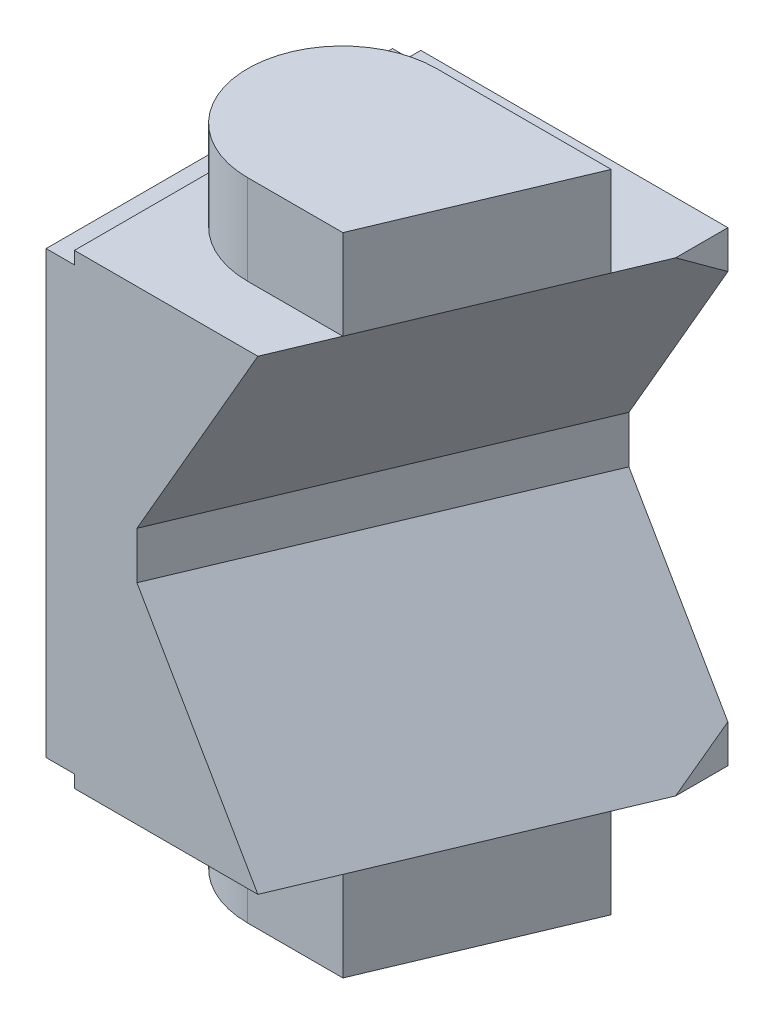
ISO-10303-21;
HEADER;
FILE_DESCRIPTION(('STEP AP214'),'2;1');
FILE_NAME('part.step','',(''),(''),'','','');
FILE_SCHEMA(('AUTOMOTIVE_DESIGN { 1 0 10303 214 1 1 1 1 }'));
ENDSEC;
DATA;
#1=APPLICATION_CONTEXT('core data for automotive mechanical design processes');
#2=APPLICATION_PROTOCOL_DEFINITION('international standard','automotive_design',2000,#1);
#3=PRODUCT_CONTEXT('',#1,'mechanical');
#4=PRODUCT('Part','Part','',(#3));
#5=PRODUCT_RELATED_PRODUCT_CATEGORY('part','',(#4));
#6=PRODUCT_DEFINITION_FORMATION('','',#4);
#7=PRODUCT_DEFINITION_CONTEXT('part definition',#1,'design');
#8=PRODUCT_DEFINITION('design','',#6,#7);
#9=PRODUCT_DEFINITION_SHAPE('','',#8);
#10=(LENGTH_UNIT() NAMED_UNIT(*) SI_UNIT(.MILLI.,.METRE.));
#11=(NAMED_UNIT(*) PLANE_ANGLE_UNIT() SI_UNIT($,.RADIAN.));
#12=(NAMED_UNIT(*) SI_UNIT($,.STERADIAN.) SOLID_ANGLE_UNIT());
#13=UNCERTAINTY_MEASURE_WITH_UNIT(LENGTH_MEASURE(1.E-05),#10,'distance_accuracy_value','');
#14=(GEOMETRIC_REPRESENTATION_CONTEXT(3) GLOBAL_UNCERTAINTY_ASSIGNED_CONTEXT((#13)) GLOBAL_UNIT_ASSIGNED_CONTEXT((#10,
#11,#12)) REPRESENTATION_CONTEXT('',''));
#15=CARTESIAN_POINT('',(0.,0.,0.));
#16=DIRECTION('',(0.,0.,1.));
#17=DIRECTION('',(1.,0.,0.));
#18=AXIS2_PLACEMENT_3D('',#15,#16,#17);
#19=CARTESIAN_POINT('',(21.3,0.,10.9));
#20=DIRECTION('',(1.,0.,0.));
#21=DIRECTION('',(0.,-1.,0.));
#22=AXIS2_PLACEMENT_3D('',#19,#20,#21);
#23=PLANE('',#22);
#24=DIRECTION('',(0.,0.,-1.));
#25=VECTOR('',#24,1.);
#26=CARTESIAN_POINT('',(21.3,14.8,22.));
#27=LINE('',#26,#25);
#28=CARTESIAN_POINT('',(21.3,14.8,3.318536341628));
#29=VERTEX_POINT('',#28);
#30=CARTESIAN_POINT('',(21.3,14.8,0.));
#31=VERTEX_POINT('',#30);
#32=EDGE_CURVE('E292',#29,#31,#27,.T.);
#33=ORIENTED_EDGE('',*,*,#32,.F.);
#34=DIRECTION('',(0.,0.588524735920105,0.808479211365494));
#35=VECTOR('',#34,1.);
#36=CARTESIAN_POINT('',(21.3,12.3843031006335,0.));
#37=LINE('',#36,#35);
#38=CARTESIAN_POINT('',(21.3,12.3843031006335,0.));
#39=VERTEX_POINT('',#38);
#40=EDGE_CURVE('E302',#39,#29,#37,.T.);
#41=ORIENTED_EDGE('',*,*,#40,.F.);
#42=DIRECTION('',(0.,-1.,0.));
#43=VECTOR('',#42,1.);
#44=CARTESIAN_POINT('',(21.3,0.,0.));
#45=LINE('',#44,#43);
#46=EDGE_CURVE('E282',#31,#39,#45,.T.);
#47=ORIENTED_EDGE('',*,*,#46,.F.);
#48=EDGE_LOOP('',(#33,#41,#47));
#49=FACE_BOUND('',#48,.T.);
#50=ADVANCED_FACE('F14',(#49),#23,.T.);
#51=CARTESIAN_POINT('',(21.3,0.,10.9));
#52=DIRECTION('',(1.,0.,0.));
#53=DIRECTION('',(0.,-1.,0.));
#54=AXIS2_PLACEMENT_3D('',#51,#52,#53);
#55=PLANE('',#54);
#56=DIRECTION('',(0.,0.588524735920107,-0.808479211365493));
#57=VECTOR('',#56,1.);
#58=CARTESIAN_POINT('',(21.3,-14.8,3.31853634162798));
#59=LINE('',#58,#57);
#60=CARTESIAN_POINT('',(21.3,-14.8,3.318536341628));
#61=VERTEX_POINT('',#60);
#62=CARTESIAN_POINT('',(21.3,-12.3843031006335,0.));
#63=VERTEX_POINT('',#62);
#64=EDGE_CURVE('E307',#61,#63,#59,.T.);
#65=ORIENTED_EDGE('',*,*,#64,.F.);
#66=DIRECTION('',(0.,0.,-1.));
#67=VECTOR('',#66,1.);
#68=CARTESIAN_POINT('',(21.3,-14.8,-0.200000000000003));
#69=LINE('',#68,#67);
#70=CARTESIAN_POINT('',(21.3,-14.8,0.));
#71=VERTEX_POINT('',#70);
#72=EDGE_CURVE('E312',#71,#61,#69,.F.);
#73=ORIENTED_EDGE('',*,*,#72,.F.);
#74=DIRECTION('',(0.,-1.,0.));
#75=VECTOR('',#74,1.);
#76=CARTESIAN_POINT('',(21.3,0.,0.));
#77=LINE('',#76,#75);
#78=EDGE_CURVE('E271',#63,#71,#77,.T.);
#79=ORIENTED_EDGE('',*,*,#78,.F.);
#80=EDGE_LOOP('',(#65,#73,#79));
#81=FACE_BOUND('',#80,.T.);
#82=ADVANCED_FACE('F373',(#81),#55,.T.);
#83=CARTESIAN_POINT('',(1.8,14.4,11.));
#84=DIRECTION('',(1.,0.,0.));
#85=DIRECTION('',(0.,0.,1.));
#86=AXIS2_PLACEMENT_3D('',#83,#84,#85);
#87=PLANE('',#86);
#88=DIRECTION('',(0.,0.,-1.));
#89=VECTOR('',#88,1.);
#90=CARTESIAN_POINT('',(1.8,14.,0.));
#91=LINE('',#90,#89);
#92=CARTESIAN_POINT('',(1.8,14.,0.));
#93=VERTEX_POINT('',#92);
#94=CARTESIAN_POINT('',(1.8,14.,22.));
#95=VERTEX_POINT('',#94);
#96=EDGE_CURVE('E262',#93,#95,#91,.F.);
#97=ORIENTED_EDGE('',*,*,#96,.T.);
#98=DIRECTION('',(0.,-1.,0.));
#99=VECTOR('',#98,1.);
#100=CARTESIAN_POINT('',(1.8,14.4,22.));
#101=LINE('',#100,#99);
#102=CARTESIAN_POINT('',(1.8,14.8,22.));
#103=VERTEX_POINT('',#102);
#104=EDGE_CURVE('E18',#103,#95,#101,.T.);
#105=ORIENTED_EDGE('',*,*,#104,.F.);
#106=DIRECTION('',(0.,0.,-1.));
#107=VECTOR('',#106,1.);
#108=CARTESIAN_POINT('',(1.8,14.8,22.));
#109=LINE('',#108,#107);
#110=CARTESIAN_POINT('',(1.8,14.8,0.));
#111=VERTEX_POINT('',#110);
#112=EDGE_CURVE('E297',#111,#103,#109,.F.);
#113=ORIENTED_EDGE('',*,*,#112,.F.);
#114=DIRECTION('',(0.,-1.,0.));
#115=VECTOR('',#114,1.);
#116=CARTESIAN_POINT('',(1.8,0.,0.));
#117=LINE('',#116,#115);
#118=EDGE_CURVE('E287',#93,#111,#117,.F.);
#119=ORIENTED_EDGE('',*,*,#118,.F.);
#120=EDGE_LOOP('',(#97,#105,#113,#119));
#121=FACE_BOUND('',#120,.T.);
#122=ADVANCED_FACE('F328',(#121),#87,.F.);
#123=CARTESIAN_POINT('',(2.,-14.8,-0.200000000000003));
#124=DIRECTION('',(0.,-1.,0.));
#125=DIRECTION('',(-1.,0.,0.));
#126=AXIS2_PLACEMENT_3D('',#123,#124,#125);
#127=PLANE('',#126);
#128=DIRECTION('',(1.,0.,0.));
#129=VECTOR('',#128,1.);
#130=CARTESIAN_POINT('',(9.,-14.8,18.2));
#131=LINE('',#130,#129);
#132=CARTESIAN_POINT('',(9.,-14.8,18.2));
#133=VERTEX_POINT('',#132);
#134=CARTESIAN_POINT('',(15.0456686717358,-14.8,18.2));
#135=VERTEX_POINT('',#134);
#136=EDGE_CURVE('E190',#133,#135,#131,.T.);
#137=ORIENTED_EDGE('',*,*,#136,.T.);
#138=DIRECTION('',(0.387449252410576,0.,-0.921891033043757));
#139=VECTOR('',#138,1.);
#140=CARTESIAN_POINT('',(13.4486174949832,-14.8,22.));
#141=LINE('',#140,#139);
#142=CARTESIAN_POINT('',(13.4486174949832,-14.8,22.));
#143=VERTEX_POINT('',#142);
#144=EDGE_CURVE('E309',#143,#135,#141,.T.);
#145=ORIENTED_EDGE('',*,*,#144,.F.);
#146=DIRECTION('',(-1.,0.,0.));
#147=VECTOR('',#146,1.);
#148=CARTESIAN_POINT('',(2.,-14.8,22.));
#149=LINE('',#148,#147);
#150=CARTESIAN_POINT('',(1.8,-14.8,22.));
#151=VERTEX_POINT('',#150);
#152=EDGE_CURVE('E257',#151,#143,#149,.F.);
#153=ORIENTED_EDGE('',*,*,#152,.F.);
#154=DIRECTION('',(0.,0.,-1.));
#155=VECTOR('',#154,1.);
#156=CARTESIAN_POINT('',(1.8,-14.8,11.));
#157=LINE('',#156,#155);
#158=CARTESIAN_POINT('',(1.8,-14.8,0.));
#159=VERTEX_POINT('',#158);
#160=EDGE_CURVE('E289',#151,#159,#157,.T.);
#161=ORIENTED_EDGE('',*,*,#160,.T.);
#162=DIRECTION('',(1.,0.,0.));
#163=VECTOR('',#162,1.);
#164=CARTESIAN_POINT('',(11.0228679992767,-14.8,0.));
#165=LINE('',#164,#163);
#166=EDGE_CURVE('E269',#71,#159,#165,.F.);
#167=ORIENTED_EDGE('',*,*,#166,.F.);
#168=ORIENTED_EDGE('',*,*,#72,.T.);
#169=CARTESIAN_POINT('',(20.0889881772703,-14.8,6.2));
#170=VERTEX_POINT('',#169);
#171=EDGE_CURVE('E311',#170,#61,#141,.T.);
#172=ORIENTED_EDGE('',*,*,#171,.F.);
#173=DIRECTION('',(-1.,0.,0.));
#174=VECTOR('',#173,1.);
#175=CARTESIAN_POINT('',(9.,-14.8,6.2));
#176=LINE('',#175,#174);
#177=CARTESIAN_POINT('',(9.,-14.8,6.2));
#178=VERTEX_POINT('',#177);
#179=EDGE_CURVE('E197',#170,#178,#176,.T.);
#180=ORIENTED_EDGE('',*,*,#179,.T.);
#181=CARTESIAN_POINT('',(9.,-14.8,12.2));
#182=DIRECTION('',(0.,-1.,0.));
#183=DIRECTION('',(-1.,0.,0.));
#184=AXIS2_PLACEMENT_3D('',#181,#182,#183);
#185=CIRCLE('',#184,6.);
#186=EDGE_CURVE('E194',#178,#133,#185,.F.);
#187=ORIENTED_EDGE('',*,*,#186,.T.);
#188=EDGE_LOOP('',(#137,#145,#153,#161,#167,#168,#172,#180,#187));
#189=FACE_BOUND('',#188,.T.);
#190=ADVANCED_FACE('F346',(#189),#127,.T.);
#191=CARTESIAN_POINT('',(15.9432315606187,-11.0406591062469,10.9));
#192=DIRECTION('',(0.813797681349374,0.469846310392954,0.342020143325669));
#193=DIRECTION('',(0.5,-0.866025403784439,0.));
#194=AXIS2_PLACEMENT_3D('',#191,#192,#193);
#195=PLANE('',#194);
#196=ORIENTED_EDGE('',*,*,#144,.T.);
#197=DIRECTION('',(0.387449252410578,0.,-0.921891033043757));
#198=VECTOR('',#197,1.);
#199=CARTESIAN_POINT('',(15.0456686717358,-14.8,18.2));
#200=LINE('',#199,#198);
#201=EDGE_CURVE('E187',#135,#170,#200,.T.);
#202=ORIENTED_EDGE('',*,*,#201,.T.);
#203=ORIENTED_EDGE('',*,*,#171,.T.);
#204=ORIENTED_EDGE('',*,*,#64,.T.);
#205=DIRECTION('',(0.5,-0.866025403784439,0.));
#206=VECTOR('',#205,1.);
#207=CARTESIAN_POINT('',(15.0159277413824,-1.4999706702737,0.));
#208=LINE('',#207,#206);
#209=CARTESIAN_POINT('',(15.0159277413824,-1.4999706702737,0.));
#210=VERTEX_POINT('',#209);
#211=EDGE_CURVE('E273',#210,#63,#208,.T.);
#212=ORIENTED_EDGE('',*,*,#211,.F.);
#213=DIRECTION('',(0.387515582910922,-0.000135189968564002,-0.921863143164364));
#214=VECTOR('',#213,1.);
#215=CARTESIAN_POINT('',(5.76797929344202,-1.49674440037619,22.));
#216=LINE('',#215,#214);
#217=CARTESIAN_POINT('',(5.76797929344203,-1.49674440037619,22.));
#218=VERTEX_POINT('',#217);
#219=EDGE_CURVE('E305',#218,#210,#216,.T.);
#220=ORIENTED_EDGE('',*,*,#219,.F.);
#221=DIRECTION('',(-0.5,0.866025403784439,0.));
#222=VECTOR('',#221,1.);
#223=CARTESIAN_POINT('',(13.4486174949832,-14.8,22.));
#224=LINE('',#223,#222);
#225=EDGE_CURVE('E255',#143,#218,#224,.T.);
#226=ORIENTED_EDGE('',*,*,#225,.F.);
#227=EDGE_LOOP('',(#196,#202,#203,#204,#212,#220,#226));
#228=FACE_BOUND('',#227,.T.);
#229=ADVANCED_FACE('F350',(#228),#195,.T.);
#230=CARTESIAN_POINT('',(10.433989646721,-8.15,10.9));
#231=DIRECTION('',(0.921863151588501,0.,0.387515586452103));
#232=DIRECTION('',(-0.387515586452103,0.,0.921863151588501));
#233=AXIS2_PLACEMENT_3D('',#230,#231,#232);
#234=PLANE('',#233);
#235=DIRECTION('',(0.,-1.,0.));
#236=VECTOR('',#235,1.);
#237=CARTESIAN_POINT('',(5.76797929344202,-14.8,22.));
#238=LINE('',#237,#236);
#239=CARTESIAN_POINT('',(5.76797929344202,1.49674440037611,22.));
#240=VERTEX_POINT('',#239);
#241=EDGE_CURVE('E253',#218,#240,#238,.F.);
#242=ORIENTED_EDGE('',*,*,#241,.F.);
#243=ORIENTED_EDGE('',*,*,#219,.T.);
#244=DIRECTION('',(0.,-1.,0.));
#245=VECTOR('',#244,1.);
#246=CARTESIAN_POINT('',(15.0159277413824,0.,0.));
#247=LINE('',#246,#245);
#248=CARTESIAN_POINT('',(15.0159277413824,1.49997067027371,0.));
#249=VERTEX_POINT('',#248);
#250=EDGE_CURVE('E276',#249,#210,#247,.T.);
#251=ORIENTED_EDGE('',*,*,#250,.F.);
#252=DIRECTION('',(0.387515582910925,0.000135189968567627,-0.921863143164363));
#253=VECTOR('',#252,1.);
#254=CARTESIAN_POINT('',(5.767979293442,1.49674440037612,22.));
#255=LINE('',#254,#253);
#256=EDGE_CURVE('E300',#240,#249,#255,.T.);
#257=ORIENTED_EDGE('',*,*,#256,.F.);
#258=EDGE_LOOP('',(#242,#243,#251,#257));
#259=FACE_BOUND('',#258,.T.);
#260=ADVANCED_FACE('F358',(#259),#234,.T.);
#261=CARTESIAN_POINT('',(6.43464357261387,-5.4286983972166,10.9));
#262=DIRECTION('',(0.813797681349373,-0.469846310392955,0.342020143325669));
#263=DIRECTION('',(-0.5,-0.866025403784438,0.));
#264=AXIS2_PLACEMENT_3D('',#261,#262,#263);
#265=PLANE('',#264);
#266=DIRECTION('',(0.5,0.866025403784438,0.));
#267=VECTOR('',#266,1.);
#268=CARTESIAN_POINT('',(5.76797929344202,1.4967444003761,22.));
#269=LINE('',#268,#267);
#270=CARTESIAN_POINT('',(13.4486174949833,14.8,22.));
#271=VERTEX_POINT('',#270);
#272=EDGE_CURVE('E251',#240,#271,#269,.T.);
#273=ORIENTED_EDGE('',*,*,#272,.F.);
#274=ORIENTED_EDGE('',*,*,#256,.T.);
#275=DIRECTION('',(-0.5,-0.866025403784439,0.));
#276=VECTOR('',#275,1.);
#277=CARTESIAN_POINT('',(21.3,12.3843031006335,0.));
#278=LINE('',#277,#276);
#279=EDGE_CURVE('E279',#39,#249,#278,.T.);
#280=ORIENTED_EDGE('',*,*,#279,.F.);
#281=ORIENTED_EDGE('',*,*,#40,.T.);
#282=DIRECTION('',(0.387449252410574,0.,-0.921891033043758));
#283=VECTOR('',#282,1.);
#284=CARTESIAN_POINT('',(13.4486174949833,14.8,22.));
#285=LINE('',#284,#283);
#286=CARTESIAN_POINT('',(20.0889881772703,14.8,6.2));
#287=VERTEX_POINT('',#286);
#288=EDGE_CURVE('E296',#287,#29,#285,.T.);
#289=ORIENTED_EDGE('',*,*,#288,.F.);
#290=DIRECTION('',(-0.387449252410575,0.,0.921891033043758));
#291=VECTOR('',#290,1.);
#292=CARTESIAN_POINT('',(15.0456686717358,14.8,18.2));
#293=LINE('',#292,#291);
#294=CARTESIAN_POINT('',(15.0456686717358,14.8,18.2));
#295=VERTEX_POINT('',#294);
#296=EDGE_CURVE('E181',#287,#295,#293,.T.);
#297=ORIENTED_EDGE('',*,*,#296,.T.);
#298=EDGE_CURVE('E294',#271,#295,#285,.T.);
#299=ORIENTED_EDGE('',*,*,#298,.F.);
#300=EDGE_LOOP('',(#273,#274,#280,#281,#289,#297,#299));
#301=FACE_BOUND('',#300,.T.);
#302=ADVANCED_FACE('F361',(#301),#265,.T.);
#303=CARTESIAN_POINT('',(2.,14.8,22.));
#304=DIRECTION('',(0.,1.,0.));
#305=DIRECTION('',(1.,0.,0.));
#306=AXIS2_PLACEMENT_3D('',#303,#304,#305);
#307=PLANE('',#306);
#308=DIRECTION('',(1.,0.,0.));
#309=VECTOR('',#308,1.);
#310=CARTESIAN_POINT('',(9.,14.8,6.2));
#311=LINE('',#310,#309);
#312=CARTESIAN_POINT('',(9.,14.8,6.2));
#313=VERTEX_POINT('',#312);
#314=EDGE_CURVE('E660',#313,#287,#311,.T.);
#315=ORIENTED_EDGE('',*,*,#314,.T.);
#316=ORIENTED_EDGE('',*,*,#288,.T.);
#317=ORIENTED_EDGE('',*,*,#32,.T.);
#318=DIRECTION('',(1.,0.,0.));
#319=VECTOR('',#318,1.);
#320=CARTESIAN_POINT('',(11.0228679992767,14.8,0.));
#321=LINE('',#320,#319);
#322=EDGE_CURVE('E284',#111,#31,#321,.T.);
#323=ORIENTED_EDGE('',*,*,#322,.F.);
#324=ORIENTED_EDGE('',*,*,#112,.T.);
#325=DIRECTION('',(-1.,0.,0.));
#326=VECTOR('',#325,1.);
#327=CARTESIAN_POINT('',(2.,14.8,22.));
#328=LINE('',#327,#326);
#329=EDGE_CURVE('E248',#271,#103,#328,.T.);
#330=ORIENTED_EDGE('',*,*,#329,.F.);
#331=ORIENTED_EDGE('',*,*,#298,.T.);
#332=DIRECTION('',(-1.,0.,0.));
#333=VECTOR('',#332,1.);
#334=CARTESIAN_POINT('',(9.,14.8,18.2));
#335=LINE('',#334,#333);
#336=CARTESIAN_POINT('',(9.,14.8,18.2));
#337=VERTEX_POINT('',#336);
#338=EDGE_CURVE('E36',#295,#337,#335,.T.);
#339=ORIENTED_EDGE('',*,*,#338,.T.);
#340=CARTESIAN_POINT('',(9.,14.8,12.2));
#341=DIRECTION('',(0.,1.,0.));
#342=DIRECTION('',(1.,0.,0.));
#343=AXIS2_PLACEMENT_3D('',#340,#341,#342);
#344=CIRCLE('',#343,6.);
#345=EDGE_CURVE('E31',#337,#313,#344,.F.);
#346=ORIENTED_EDGE('',*,*,#345,.T.);
#347=EDGE_LOOP('',(#315,#316,#317,#323,#324,#330,#331,#339,#346));
#348=FACE_BOUND('',#347,.T.);
#349=ADVANCED_FACE('F365',(#348),#307,.T.);
#350=CARTESIAN_POINT('',(1.8,-14.4,11.));
#351=DIRECTION('',(1.,0.,0.));
#352=DIRECTION('',(0.,-1.,0.));
#353=AXIS2_PLACEMENT_3D('',#350,#351,#352);
#354=PLANE('',#353);
#355=DIRECTION('',(0.,0.,-1.));
#356=VECTOR('',#355,1.);
#357=CARTESIAN_POINT('',(1.8,-14.,22.));
#358=LINE('',#357,#356);
#359=CARTESIAN_POINT('',(1.8,-14.,22.));
#360=VERTEX_POINT('',#359);
#361=CARTESIAN_POINT('',(1.8,-14.,0.));
#362=VERTEX_POINT('',#361);
#363=EDGE_CURVE('E239',#360,#362,#358,.T.);
#364=ORIENTED_EDGE('',*,*,#363,.T.);
#365=DIRECTION('',(0.,-1.,0.));
#366=VECTOR('',#365,1.);
#367=CARTESIAN_POINT('',(1.8,0.,0.));
#368=LINE('',#367,#366);
#369=EDGE_CURVE('E267',#159,#362,#368,.F.);
#370=ORIENTED_EDGE('',*,*,#369,.F.);
#371=ORIENTED_EDGE('',*,*,#160,.F.);
#372=DIRECTION('',(0.,-1.,0.));
#373=VECTOR('',#372,1.);
#374=CARTESIAN_POINT('',(1.8,-14.8,22.));
#375=LINE('',#374,#373);
#376=EDGE_CURVE('E259',#360,#151,#375,.T.);
#377=ORIENTED_EDGE('',*,*,#376,.F.);
#378=EDGE_LOOP('',(#364,#370,#371,#377));
#379=FACE_BOUND('',#378,.T.);
#380=ADVANCED_FACE('F408',(#379),#354,.F.);
#381=CARTESIAN_POINT('',(11.0228679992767,0.,0.));
#382=DIRECTION('',(0.,0.,-1.));
#383=DIRECTION('',(1.,0.,0.));
#384=AXIS2_PLACEMENT_3D('',#381,#382,#383);
#385=PLANE('',#384);
#386=DIRECTION('',(1.,0.,0.));
#387=VECTOR('',#386,1.);
#388=CARTESIAN_POINT('',(0.,-14.,0.));
#389=LINE('',#388,#387);
#390=CARTESIAN_POINT('',(0.,-14.,0.));
#391=VERTEX_POINT('',#390);
#392=EDGE_CURVE('E237',#362,#391,#389,.F.);
#393=ORIENTED_EDGE('',*,*,#392,.T.);
#394=DIRECTION('',(0.,1.,0.));
#395=VECTOR('',#394,1.);
#396=CARTESIAN_POINT('',(0.,-14.915922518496,0.));
#397=LINE('',#396,#395);
#398=CARTESIAN_POINT('',(0.,14.,0.));
#399=VERTEX_POINT('',#398);
#400=EDGE_CURVE('E228',#391,#399,#397,.T.);
#401=ORIENTED_EDGE('',*,*,#400,.T.);
#402=DIRECTION('',(-1.,0.,0.));
#403=VECTOR('',#402,1.);
#404=CARTESIAN_POINT('',(0.,14.,0.));
#405=LINE('',#404,#403);
#406=EDGE_CURVE('E265',#399,#93,#405,.F.);
#407=ORIENTED_EDGE('',*,*,#406,.T.);
#408=ORIENTED_EDGE('',*,*,#118,.T.);
#409=ORIENTED_EDGE('',*,*,#322,.T.);
#410=ORIENTED_EDGE('',*,*,#46,.T.);
#411=ORIENTED_EDGE('',*,*,#279,.T.);
#412=ORIENTED_EDGE('',*,*,#250,.T.);
#413=ORIENTED_EDGE('',*,*,#211,.T.);
#414=ORIENTED_EDGE('',*,*,#78,.T.);
#415=ORIENTED_EDGE('',*,*,#166,.T.);
#416=ORIENTED_EDGE('',*,*,#369,.T.);
#417=EDGE_LOOP('',(#393,#401,#407,#408,#409,#410,#411,#412,#413,#414,#415,#416));
#418=FACE_BOUND('',#417,.T.);
#419=ADVANCED_FACE('F337',(#418),#385,.T.);
#420=CARTESIAN_POINT('',(0.,14.,0.));
#421=DIRECTION('',(0.,-1.,0.));
#422=DIRECTION('',(-1.,0.,0.));
#423=AXIS2_PLACEMENT_3D('',#420,#421,#422);
#424=PLANE('',#423);
#425=ORIENTED_EDGE('',*,*,#96,.F.);
#426=ORIENTED_EDGE('',*,*,#406,.F.);
#427=DIRECTION('',(0.,0.,-1.));
#428=VECTOR('',#427,1.);
#429=CARTESIAN_POINT('',(0.,14.,11.));
#430=LINE('',#429,#428);
#431=CARTESIAN_POINT('',(0.,14.,22.));
#432=VERTEX_POINT('',#431);
#433=EDGE_CURVE('E235',#399,#432,#430,.F.);
#434=ORIENTED_EDGE('',*,*,#433,.T.);
#435=DIRECTION('',(-1.,0.,0.));
#436=VECTOR('',#435,1.);
#437=CARTESIAN_POINT('',(2.,14.,22.));
#438=LINE('',#437,#436);
#439=EDGE_CURVE('E245',#95,#432,#438,.T.);
#440=ORIENTED_EDGE('',*,*,#439,.F.);
#441=EDGE_LOOP('',(#425,#426,#434,#440));
#442=FACE_BOUND('',#441,.T.);
#443=ADVANCED_FACE('F330',(#442),#424,.F.);
#444=CARTESIAN_POINT('',(2.,-14.8,22.));
#445=DIRECTION('',(0.,0.,1.));
#446=DIRECTION('',(-1.,0.,0.));
#447=AXIS2_PLACEMENT_3D('',#444,#445,#446);
#448=PLANE('',#447);
#449=DIRECTION('',(0.,-1.,0.));
#450=VECTOR('',#449,1.);
#451=CARTESIAN_POINT('',(0.,0.,22.));
#452=LINE('',#451,#450);
#453=CARTESIAN_POINT('',(0.,-14.,22.));
#454=VERTEX_POINT('',#453);
#455=EDGE_CURVE('E23',#432,#454,#452,.T.);
#456=ORIENTED_EDGE('',*,*,#455,.T.);
#457=DIRECTION('',(1.,0.,0.));
#458=VECTOR('',#457,1.);
#459=CARTESIAN_POINT('',(0.,-14.,22.));
#460=LINE('',#459,#458);
#461=EDGE_CURVE('E242',#454,#360,#460,.T.);
#462=ORIENTED_EDGE('',*,*,#461,.T.);
#463=ORIENTED_EDGE('',*,*,#376,.T.);
#464=ORIENTED_EDGE('',*,*,#152,.T.);
#465=ORIENTED_EDGE('',*,*,#225,.T.);
#466=ORIENTED_EDGE('',*,*,#241,.T.);
#467=ORIENTED_EDGE('',*,*,#272,.T.);
#468=ORIENTED_EDGE('',*,*,#329,.T.);
#469=ORIENTED_EDGE('',*,*,#104,.T.);
#470=ORIENTED_EDGE('',*,*,#439,.T.);
#471=EDGE_LOOP('',(#456,#462,#463,#464,#465,#466,#467,#468,#469,#470));
#472=FACE_BOUND('',#471,.T.);
#473=ADVANCED_FACE('F320',(#472),#448,.T.);
#474=CARTESIAN_POINT('',(0.,-14.,22.));
#475=DIRECTION('',(0.,1.,0.));
#476=DIRECTION('',(1.,0.,0.));
#477=AXIS2_PLACEMENT_3D('',#474,#475,#476);
#478=PLANE('',#477);
#479=DIRECTION('',(0.,0.,-1.));
#480=VECTOR('',#479,1.);
#481=CARTESIAN_POINT('',(0.,-14.,11.));
#482=LINE('',#481,#480);
#483=EDGE_CURVE('E9',#454,#391,#482,.T.);
#484=ORIENTED_EDGE('',*,*,#483,.T.);
#485=ORIENTED_EDGE('',*,*,#392,.F.);
#486=ORIENTED_EDGE('',*,*,#363,.F.);
#487=ORIENTED_EDGE('',*,*,#461,.F.);
#488=EDGE_LOOP('',(#484,#485,#486,#487));
#489=FACE_BOUND('',#488,.T.);
#490=ADVANCED_FACE('F342',(#489),#478,.F.);
#491=CARTESIAN_POINT('',(0.,0.,11.));
#492=DIRECTION('',(1.,0.,0.));
#493=DIRECTION('',(0.,-1.,0.));
#494=AXIS2_PLACEMENT_3D('',#491,#492,#493);
#495=PLANE('',#494);
#496=CARTESIAN_POINT('',(0.,9.,11.));
#497=DIRECTION('',(-1.,0.,0.));
#498=DIRECTION('',(0.,1.,0.));
#499=AXIS2_PLACEMENT_3D('',#496,#497,#498);
#500=CIRCLE('',#499,2.5);
#501=CARTESIAN_POINT('',(0.,11.5,11.));
#502=VERTEX_POINT('',#501);
#503=EDGE_CURVE('E218',#502,#502,#500,.T.);
#504=ORIENTED_EDGE('',*,*,#503,.F.);
#505=EDGE_LOOP('',(#504));
#506=FACE_BOUND('',#505,.T.);
#507=CARTESIAN_POINT('',(0.,-9.,11.));
#508=DIRECTION('',(-1.,0.,0.));
#509=DIRECTION('',(0.,1.,0.));
#510=AXIS2_PLACEMENT_3D('',#507,#508,#509);
#511=CIRCLE('',#510,2.5);
#512=CARTESIAN_POINT('',(0.,-6.5,11.));
#513=VERTEX_POINT('',#512);
#514=EDGE_CURVE('E222',#513,#513,#511,.T.);
#515=ORIENTED_EDGE('',*,*,#514,.F.);
#516=EDGE_LOOP('',(#515));
#517=FACE_BOUND('',#516,.T.);
#518=ORIENTED_EDGE('',*,*,#455,.F.);
#519=ORIENTED_EDGE('',*,*,#433,.F.);
#520=ORIENTED_EDGE('',*,*,#400,.F.);
#521=ORIENTED_EDGE('',*,*,#483,.F.);
#522=EDGE_LOOP('',(#518,#519,#520,#521));
#523=FACE_BOUND('',#522,.T.);
#524=ADVANCED_FACE('F334',(#506,#517,#523),#495,.F.);
#525=CARTESIAN_POINT('',(7.,-9.,11.));
#526=DIRECTION('',(-1.,0.,0.));
#527=DIRECTION('',(0.,1.,0.));
#528=AXIS2_PLACEMENT_3D('',#525,#526,#527);
#529=PLANE('',#528);
#530=CARTESIAN_POINT('',(7.,-9.,11.));
#531=DIRECTION('',(-1.,0.,0.));
#532=DIRECTION('',(0.,1.,0.));
#533=AXIS2_PLACEMENT_3D('',#530,#531,#532);
#534=CIRCLE('',#533,2.5);
#535=CARTESIAN_POINT('',(7.,-6.5,11.));
#536=VERTEX_POINT('',#535);
#537=EDGE_CURVE('E225',#536,#536,#534,.T.);
#538=ORIENTED_EDGE('',*,*,#537,.T.);
#539=EDGE_LOOP('',(#538));
#540=FACE_BOUND('',#539,.T.);
#541=ADVANCED_FACE('F384',(#540),#529,.T.);
#542=CARTESIAN_POINT('',(7.,-9.,11.));
#543=DIRECTION('',(-1.,0.,0.));
#544=DIRECTION('',(0.,1.,0.));
#545=AXIS2_PLACEMENT_3D('',#542,#543,#544);
#546=CYLINDRICAL_SURFACE('',#545,2.5);
#547=ORIENTED_EDGE('',*,*,#537,.F.);
#548=EDGE_LOOP('',(#547));
#549=FACE_BOUND('',#548,.T.);
#550=ORIENTED_EDGE('',*,*,#514,.T.);
#551=EDGE_LOOP('',(#550));
#552=FACE_BOUND('',#551,.T.);
#553=ADVANCED_FACE('F394',(#549,#552),#546,.F.);
#554=CARTESIAN_POINT('',(7.,9.,11.));
#555=DIRECTION('',(-1.,0.,0.));
#556=DIRECTION('',(0.,1.,0.));
#557=AXIS2_PLACEMENT_3D('',#554,#555,#556);
#558=PLANE('',#557);
#559=CARTESIAN_POINT('',(7.,9.,11.));
#560=DIRECTION('',(-1.,0.,0.));
#561=DIRECTION('',(0.,1.,0.));
#562=AXIS2_PLACEMENT_3D('',#559,#560,#561);
#563=CIRCLE('',#562,2.5);
#564=CARTESIAN_POINT('',(7.,11.5,11.));
#565=VERTEX_POINT('',#564);
#566=EDGE_CURVE('E219',#565,#565,#563,.T.);
#567=ORIENTED_EDGE('',*,*,#566,.T.);
#568=EDGE_LOOP('',(#567));
#569=FACE_BOUND('',#568,.T.);
#570=ADVANCED_FACE('F521',(#569),#558,.T.);
#571=CARTESIAN_POINT('',(7.,9.,11.));
#572=DIRECTION('',(-1.,0.,0.));
#573=DIRECTION('',(0.,1.,0.));
#574=AXIS2_PLACEMENT_3D('',#571,#572,#573);
#575=CYLINDRICAL_SURFACE('',#574,2.5);
#576=ORIENTED_EDGE('',*,*,#566,.F.);
#577=EDGE_LOOP('',(#576));
#578=FACE_BOUND('',#577,.T.);
#579=ORIENTED_EDGE('',*,*,#503,.T.);
#580=EDGE_LOOP('',(#579));
#581=FACE_BOUND('',#580,.T.);
#582=ADVANCED_FACE('F530',(#578,#581),#575,.F.);
#583=CARTESIAN_POINT('',(9.,6.08141558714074,12.2));
#584=DIRECTION('',(0.,-1.,0.));
#585=DIRECTION('',(-1.,0.,0.));
#586=AXIS2_PLACEMENT_3D('',#583,#584,#585);
#587=CYLINDRICAL_SURFACE('',#586,6.);
#588=ORIENTED_EDGE('',*,*,#186,.F.);
#589=DIRECTION('',(0.,-1.,0.));
#590=VECTOR('',#589,1.);
#591=CARTESIAN_POINT('',(9.,6.08141558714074,6.2));
#592=LINE('',#591,#590);
#593=CARTESIAN_POINT('',(9.,-20.5,6.2));
#594=VERTEX_POINT('',#593);
#595=EDGE_CURVE('E209',#178,#594,#592,.T.);
#596=ORIENTED_EDGE('',*,*,#595,.T.);
#597=CARTESIAN_POINT('',(9.,-20.5,12.2));
#598=DIRECTION('',(0.,-1.,0.));
#599=DIRECTION('',(-1.,0.,0.));
#600=AXIS2_PLACEMENT_3D('',#597,#598,#599);
#601=CIRCLE('',#600,6.);
#602=CARTESIAN_POINT('',(9.,-20.5,18.2));
#603=VERTEX_POINT('',#602);
#604=EDGE_CURVE('E186',#603,#594,#601,.T.);
#605=ORIENTED_EDGE('',*,*,#604,.F.);
#606=DIRECTION('',(0.,-1.,0.));
#607=VECTOR('',#606,1.);
#608=CARTESIAN_POINT('',(9.,6.08141558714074,18.2));
#609=LINE('',#608,#607);
#610=EDGE_CURVE('E191',#133,#603,#609,.T.);
#611=ORIENTED_EDGE('',*,*,#610,.F.);
#612=EDGE_LOOP('',(#588,#596,#605,#611));
#613=FACE_BOUND('',#612,.T.);
#614=ADVANCED_FACE('F541',(#613),#587,.T.);
#615=CARTESIAN_POINT('',(9.,6.08141558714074,18.2));
#616=DIRECTION('',(0.,0.,1.));
#617=DIRECTION('',(-1.,0.,0.));
#618=AXIS2_PLACEMENT_3D('',#615,#616,#617);
#619=PLANE('',#618);
#620=ORIENTED_EDGE('',*,*,#136,.F.);
#621=ORIENTED_EDGE('',*,*,#610,.T.);
#622=DIRECTION('',(-1.,0.,0.));
#623=VECTOR('',#622,1.);
#624=CARTESIAN_POINT('',(9.,-20.5,18.2));
#625=LINE('',#624,#623);
#626=CARTESIAN_POINT('',(15.0456686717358,-20.5,18.2));
#627=VERTEX_POINT('',#626);
#628=EDGE_CURVE('E206',#627,#603,#625,.T.);
#629=ORIENTED_EDGE('',*,*,#628,.F.);
#630=DIRECTION('',(0.,-1.,0.));
#631=VECTOR('',#630,1.);
#632=CARTESIAN_POINT('',(15.0456686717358,6.08141558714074,18.2));
#633=LINE('',#632,#631);
#634=EDGE_CURVE('E211',#135,#627,#633,.T.);
#635=ORIENTED_EDGE('',*,*,#634,.F.);
#636=EDGE_LOOP('',(#620,#621,#629,#635));
#637=FACE_BOUND('',#636,.T.);
#638=ADVANCED_FACE('F552',(#637),#619,.T.);
#639=CARTESIAN_POINT('',(15.0456686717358,6.08141558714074,18.2));
#640=DIRECTION('',(0.921891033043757,0.,0.387449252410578));
#641=DIRECTION('',(-0.387449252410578,0.,0.921891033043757));
#642=AXIS2_PLACEMENT_3D('',#639,#640,#641);
#643=PLANE('',#642);
#644=ORIENTED_EDGE('',*,*,#201,.F.);
#645=ORIENTED_EDGE('',*,*,#634,.T.);
#646=DIRECTION('',(-0.387449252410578,0.,0.921891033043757));
#647=VECTOR('',#646,1.);
#648=CARTESIAN_POINT('',(15.0456686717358,-20.5,18.2));
#649=LINE('',#648,#647);
#650=CARTESIAN_POINT('',(20.0889881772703,-20.5,6.2));
#651=VERTEX_POINT('',#650);
#652=EDGE_CURVE('E203',#651,#627,#649,.T.);
#653=ORIENTED_EDGE('',*,*,#652,.F.);
#654=DIRECTION('',(0.,-1.,0.));
#655=VECTOR('',#654,1.);
#656=CARTESIAN_POINT('',(20.0889881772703,6.08141558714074,6.2));
#657=LINE('',#656,#655);
#658=EDGE_CURVE('E213',#170,#651,#657,.T.);
#659=ORIENTED_EDGE('',*,*,#658,.F.);
#660=EDGE_LOOP('',(#644,#645,#653,#659));
#661=FACE_BOUND('',#660,.T.);
#662=ADVANCED_FACE('F563',(#661),#643,.T.);
#663=CARTESIAN_POINT('',(9.,6.08141558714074,6.2));
#664=DIRECTION('',(0.,0.,-1.));
#665=DIRECTION('',(0.,1.,0.));
#666=AXIS2_PLACEMENT_3D('',#663,#664,#665);
#667=PLANE('',#666);
#668=ORIENTED_EDGE('',*,*,#179,.F.);
#669=ORIENTED_EDGE('',*,*,#658,.T.);
#670=DIRECTION('',(1.,0.,0.));
#671=VECTOR('',#670,1.);
#672=CARTESIAN_POINT('',(9.,-20.5,6.2));
#673=LINE('',#672,#671);
#674=EDGE_CURVE('E200',#594,#651,#673,.T.);
#675=ORIENTED_EDGE('',*,*,#674,.F.);
#676=ORIENTED_EDGE('',*,*,#595,.F.);
#677=EDGE_LOOP('',(#668,#669,#675,#676));
#678=FACE_BOUND('',#677,.T.);
#679=ADVANCED_FACE('F574',(#678),#667,.T.);
#680=CARTESIAN_POINT('',(9.6545990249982,-20.5,12.2));
#681=DIRECTION('',(0.,-1.,0.));
#682=DIRECTION('',(-1.,0.,0.));
#683=AXIS2_PLACEMENT_3D('',#680,#681,#682);
#684=PLANE('',#683);
#685=ORIENTED_EDGE('',*,*,#604,.T.);
#686=ORIENTED_EDGE('',*,*,#674,.T.);
#687=ORIENTED_EDGE('',*,*,#652,.T.);
#688=ORIENTED_EDGE('',*,*,#628,.T.);
#689=EDGE_LOOP('',(#685,#686,#687,#688));
#690=FACE_BOUND('',#689,.T.);
#691=ADVANCED_FACE('F16',(#690),#684,.T.);
#692=CARTESIAN_POINT('',(9.,-6.08141558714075,12.2));
#693=DIRECTION('',(0.,1.,0.));
#694=DIRECTION('',(1.,0.,0.));
#695=AXIS2_PLACEMENT_3D('',#692,#693,#694);
#696=CYLINDRICAL_SURFACE('',#695,6.);
#697=ORIENTED_EDGE('',*,*,#345,.F.);
#698=DIRECTION('',(0.,1.,0.));
#699=VECTOR('',#698,1.);
#700=CARTESIAN_POINT('',(9.,-6.08141558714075,18.2));
#701=LINE('',#700,#699);
#702=CARTESIAN_POINT('',(9.,20.5,18.2));
#703=VERTEX_POINT('',#702);
#704=EDGE_CURVE('E151',#337,#703,#701,.T.);
#705=ORIENTED_EDGE('',*,*,#704,.T.);
#706=CARTESIAN_POINT('',(9.,20.5,12.2));
#707=DIRECTION('',(0.,1.,0.));
#708=DIRECTION('',(1.,0.,0.));
#709=AXIS2_PLACEMENT_3D('',#706,#707,#708);
#710=CIRCLE('',#709,6.);
#711=CARTESIAN_POINT('',(9.,20.5,6.2));
#712=VERTEX_POINT('',#711);
#713=EDGE_CURVE('E156',#712,#703,#710,.T.);
#714=ORIENTED_EDGE('',*,*,#713,.F.);
#715=DIRECTION('',(0.,1.,0.));
#716=VECTOR('',#715,1.);
#717=CARTESIAN_POINT('',(9.,-6.08141558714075,6.2));
#718=LINE('',#717,#716);
#719=EDGE_CURVE('E179',#313,#712,#718,.T.);
#720=ORIENTED_EDGE('',*,*,#719,.F.);
#721=EDGE_LOOP('',(#697,#705,#714,#720));
#722=FACE_BOUND('',#721,.T.);
#723=ADVANCED_FACE('F153',(#722),#696,.T.);
#724=CARTESIAN_POINT('',(9.,-6.08141558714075,6.2));
#725=DIRECTION('',(0.,0.,-1.));
#726=DIRECTION('',(0.,1.,0.));
#727=AXIS2_PLACEMENT_3D('',#724,#725,#726);
#728=PLANE('',#727);
#729=ORIENTED_EDGE('',*,*,#314,.F.);
#730=ORIENTED_EDGE('',*,*,#719,.T.);
#731=DIRECTION('',(-1.,0.,0.));
#732=VECTOR('',#731,1.);
#733=CARTESIAN_POINT('',(9.,20.5,6.2));
#734=LINE('',#733,#732);
#735=CARTESIAN_POINT('',(20.0889881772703,20.5,6.2));
#736=VERTEX_POINT('',#735);
#737=EDGE_CURVE('E160',#736,#712,#734,.T.);
#738=ORIENTED_EDGE('',*,*,#737,.F.);
#739=DIRECTION('',(0.,1.,0.));
#740=VECTOR('',#739,1.);
#741=CARTESIAN_POINT('',(20.0889881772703,-6.08141558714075,6.2));
#742=LINE('',#741,#740);
#743=EDGE_CURVE('E182',#287,#736,#742,.T.);
#744=ORIENTED_EDGE('',*,*,#743,.F.);
#745=EDGE_LOOP('',(#729,#730,#738,#744));
#746=FACE_BOUND('',#745,.T.);
#747=ADVANCED_FACE('F602',(#746),#728,.T.);
#748=CARTESIAN_POINT('',(15.0456686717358,-6.08141558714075,18.2));
#749=DIRECTION('',(0.921891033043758,0.,0.387449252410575));
#750=DIRECTION('',(-0.387449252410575,0.,0.921891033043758));
#751=AXIS2_PLACEMENT_3D('',#748,#749,#750);
#752=PLANE('',#751);
#753=ORIENTED_EDGE('',*,*,#296,.F.);
#754=ORIENTED_EDGE('',*,*,#743,.T.);
#755=DIRECTION('',(0.387449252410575,0.,-0.921891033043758));
#756=VECTOR('',#755,1.);
#757=CARTESIAN_POINT('',(15.0456686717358,20.5,18.2));
#758=LINE('',#757,#756);
#759=CARTESIAN_POINT('',(15.0456686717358,20.5,18.2));
#760=VERTEX_POINT('',#759);
#761=EDGE_CURVE('E169',#760,#736,#758,.T.);
#762=ORIENTED_EDGE('',*,*,#761,.F.);
#763=DIRECTION('',(0.,1.,0.));
#764=VECTOR('',#763,1.);
#765=CARTESIAN_POINT('',(15.0456686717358,-6.08141558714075,18.2));
#766=LINE('',#765,#764);
#767=EDGE_CURVE('E159',#295,#760,#766,.T.);
#768=ORIENTED_EDGE('',*,*,#767,.F.);
#769=EDGE_LOOP('',(#753,#754,#762,#768));
#770=FACE_BOUND('',#769,.T.);
#771=ADVANCED_FACE('F612',(#770),#752,.T.);
#772=CARTESIAN_POINT('',(9.,-6.08141558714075,18.2));
#773=DIRECTION('',(0.,0.,1.));
#774=DIRECTION('',(0.,-1.,0.));
#775=AXIS2_PLACEMENT_3D('',#772,#773,#774);
#776=PLANE('',#775);
#777=ORIENTED_EDGE('',*,*,#338,.F.);
#778=ORIENTED_EDGE('',*,*,#767,.T.);
#779=DIRECTION('',(1.,0.,0.));
#780=VECTOR('',#779,1.);
#781=CARTESIAN_POINT('',(9.,20.5,18.2));
#782=LINE('',#781,#780);
#783=EDGE_CURVE('E163',#703,#760,#782,.T.);
#784=ORIENTED_EDGE('',*,*,#783,.F.);
#785=ORIENTED_EDGE('',*,*,#704,.F.);
#786=EDGE_LOOP('',(#777,#778,#784,#785));
#787=FACE_BOUND('',#786,.T.);
#788=ADVANCED_FACE('F164',(#787),#776,.T.);
#789=CARTESIAN_POINT('',(9.6545990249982,20.5,12.2));
#790=DIRECTION('',(0.,-1.,0.));
#791=DIRECTION('',(-1.,0.,0.));
#792=AXIS2_PLACEMENT_3D('',#789,#790,#791);
#793=PLANE('',#792);
#794=ORIENTED_EDGE('',*,*,#713,.T.);
#795=ORIENTED_EDGE('',*,*,#783,.T.);
#796=ORIENTED_EDGE('',*,*,#761,.T.);
#797=ORIENTED_EDGE('',*,*,#737,.T.);
#798=EDGE_LOOP('',(#794,#795,#796,#797));
#799=FACE_BOUND('',#798,.T.);
#800=ADVANCED_FACE('F171',(#799),#793,.F.);
#801=CLOSED_SHELL('',(#50,#82,#122,#190,#229,#260,#302,#349,#380,#419,#443,#473,#490,#524,#541,
#553,#570,#582,#614,#638,#662,#679,#691,#723,#747,#771,#788,#800));
#802=MANIFOLD_SOLID_BREP('B1',#801);
#803=ADVANCED_BREP_SHAPE_REPRESENTATION('',(#18,#802),#14);
#804=SHAPE_DEFINITION_REPRESENTATION(#9,#803);
ENDSEC;
END-ISO-10303-21;
